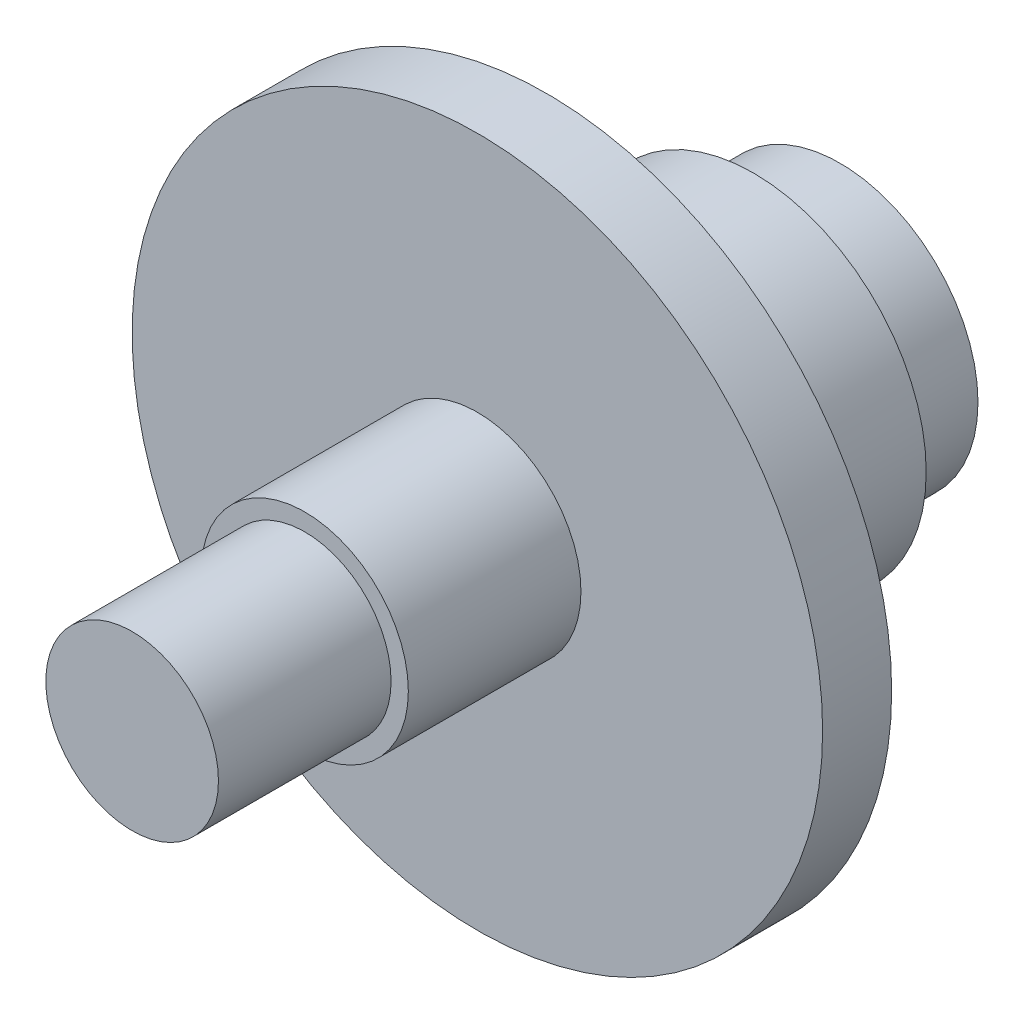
ISO-10303-21;
HEADER;
FILE_DESCRIPTION(('STEP AP214'),'2;1');
FILE_NAME('part.step','',(''),(''),'','','');
FILE_SCHEMA(('AUTOMOTIVE_DESIGN { 1 0 10303 214 1 1 1 1 }'));
ENDSEC;
DATA;
#1=APPLICATION_CONTEXT('core data for automotive mechanical design processes');
#2=APPLICATION_PROTOCOL_DEFINITION('international standard','automotive_design',2000,#1);
#3=PRODUCT_CONTEXT('',#1,'mechanical');
#4=PRODUCT('Part','Part','',(#3));
#5=PRODUCT_RELATED_PRODUCT_CATEGORY('part','',(#4));
#6=PRODUCT_DEFINITION_FORMATION('','',#4);
#7=PRODUCT_DEFINITION_CONTEXT('part definition',#1,'design');
#8=PRODUCT_DEFINITION('design','',#6,#7);
#9=PRODUCT_DEFINITION_SHAPE('','',#8);
#10=(LENGTH_UNIT() NAMED_UNIT(*) SI_UNIT(.MILLI.,.METRE.));
#11=(NAMED_UNIT(*) PLANE_ANGLE_UNIT() SI_UNIT($,.RADIAN.));
#12=(NAMED_UNIT(*) SI_UNIT($,.STERADIAN.) SOLID_ANGLE_UNIT());
#13=UNCERTAINTY_MEASURE_WITH_UNIT(LENGTH_MEASURE(1.E-05),#10,'distance_accuracy_value','');
#14=(GEOMETRIC_REPRESENTATION_CONTEXT(3) GLOBAL_UNCERTAINTY_ASSIGNED_CONTEXT((#13)) GLOBAL_UNIT_ASSIGNED_CONTEXT((#10,
#11,#12)) REPRESENTATION_CONTEXT('',''));
#15=CARTESIAN_POINT('',(0.,0.,0.));
#16=DIRECTION('',(0.,0.,1.));
#17=DIRECTION('',(1.,0.,0.));
#18=AXIS2_PLACEMENT_3D('',#15,#16,#17);
#19=CARTESIAN_POINT('',(0.,0.,15.5));
#20=DIRECTION('',(0.,0.,1.));
#21=DIRECTION('',(1.,0.,0.));
#22=AXIS2_PLACEMENT_3D('',#19,#20,#21);
#23=PLANE('',#22);
#24=CARTESIAN_POINT('',(0.,0.,15.5));
#25=DIRECTION('',(0.,0.,1.));
#26=DIRECTION('',(1.,0.,0.));
#27=AXIS2_PLACEMENT_3D('',#24,#25,#26);
#28=CIRCLE('',#27,3.);
#29=CARTESIAN_POINT('',(3.,0.,15.5));
#30=VERTEX_POINT('',#29);
#31=EDGE_CURVE('E66',#30,#30,#28,.T.);
#32=ORIENTED_EDGE('',*,*,#31,.T.);
#33=EDGE_LOOP('',(#32));
#34=FACE_BOUND('',#33,.T.);
#35=CARTESIAN_POINT('',(0.,0.,15.5));
#36=DIRECTION('',(0.,0.,1.));
#37=DIRECTION('',(1.,0.,0.));
#38=AXIS2_PLACEMENT_3D('',#35,#36,#37);
#39=CIRCLE('',#38,2.5);
#40=CARTESIAN_POINT('',(2.5,0.,15.5));
#41=VERTEX_POINT('',#40);
#42=EDGE_CURVE('E54',#41,#41,#39,.T.);
#43=ORIENTED_EDGE('',*,*,#42,.F.);
#44=EDGE_LOOP('',(#43));
#45=FACE_BOUND('',#44,.T.);
#46=ADVANCED_FACE('F34',(#34,#45),#23,.T.);
#47=CARTESIAN_POINT('',(0.,0.,10.5));
#48=DIRECTION('',(0.,0.,1.));
#49=DIRECTION('',(1.,0.,0.));
#50=AXIS2_PLACEMENT_3D('',#47,#48,#49);
#51=PLANE('',#50);
#52=CARTESIAN_POINT('',(0.,0.,10.5));
#53=DIRECTION('',(0.,0.,1.));
#54=DIRECTION('',(1.,0.,0.));
#55=AXIS2_PLACEMENT_3D('',#52,#53,#54);
#56=CIRCLE('',#55,10.);
#57=CARTESIAN_POINT('',(10.,0.,10.5));
#58=VERTEX_POINT('',#57);
#59=EDGE_CURVE('E72',#58,#58,#56,.T.);
#60=ORIENTED_EDGE('',*,*,#59,.T.);
#61=EDGE_LOOP('',(#60));
#62=FACE_BOUND('',#61,.T.);
#63=CARTESIAN_POINT('',(0.,0.,10.5));
#64=DIRECTION('',(0.,0.,1.));
#65=DIRECTION('',(1.,0.,0.));
#66=AXIS2_PLACEMENT_3D('',#63,#64,#65);
#67=CIRCLE('',#66,3.);
#68=CARTESIAN_POINT('',(3.,0.,10.5));
#69=VERTEX_POINT('',#68);
#70=EDGE_CURVE('E64',#69,#69,#67,.T.);
#71=ORIENTED_EDGE('',*,*,#70,.F.);
#72=EDGE_LOOP('',(#71));
#73=FACE_BOUND('',#72,.T.);
#74=ADVANCED_FACE('F95',(#62,#73),#51,.T.);
#75=CARTESIAN_POINT('',(0.,0.,2.5));
#76=DIRECTION('',(0.,0.,-1.));
#77=DIRECTION('',(-1.,0.,0.));
#78=AXIS2_PLACEMENT_3D('',#75,#76,#77);
#79=CYLINDRICAL_SURFACE('',#78,4.);
#80=CARTESIAN_POINT('',(0.,0.,2.5));
#81=DIRECTION('',(0.,0.,1.));
#82=DIRECTION('',(1.,0.,0.));
#83=AXIS2_PLACEMENT_3D('',#80,#81,#82);
#84=CIRCLE('',#83,4.);
#85=CARTESIAN_POINT('',(4.,0.,2.5));
#86=VERTEX_POINT('',#85);
#87=EDGE_CURVE('E11',#86,#86,#84,.T.);
#88=ORIENTED_EDGE('',*,*,#87,.F.);
#89=EDGE_LOOP('',(#88));
#90=FACE_BOUND('',#89,.T.);
#91=CARTESIAN_POINT('',(0.,0.,0.));
#92=DIRECTION('',(0.,0.,1.));
#93=DIRECTION('',(1.,0.,0.));
#94=AXIS2_PLACEMENT_3D('',#91,#92,#93);
#95=CIRCLE('',#94,4.);
#96=CARTESIAN_POINT('',(4.,0.,0.));
#97=VERTEX_POINT('',#96);
#98=EDGE_CURVE('E38',#97,#97,#95,.T.);
#99=ORIENTED_EDGE('',*,*,#98,.T.);
#100=EDGE_LOOP('',(#99));
#101=FACE_BOUND('',#100,.T.);
#102=ADVANCED_FACE('F36',(#90,#101),#79,.T.);
#103=CARTESIAN_POINT('',(0.,0.,0.));
#104=DIRECTION('',(0.,0.,1.));
#105=DIRECTION('',(1.,0.,0.));
#106=AXIS2_PLACEMENT_3D('',#103,#104,#105);
#107=PLANE('',#106);
#108=CARTESIAN_POINT('',(0.,0.,0.));
#109=DIRECTION('',(0.,0.,-1.));
#110=DIRECTION('',(-1.,0.,0.));
#111=AXIS2_PLACEMENT_3D('',#108,#109,#110);
#112=CIRCLE('',#111,2.5);
#113=CARTESIAN_POINT('',(-2.5,0.,0.));
#114=VERTEX_POINT('',#113);
#115=EDGE_CURVE('E55',#114,#114,#112,.T.);
#116=ORIENTED_EDGE('',*,*,#115,.F.);
#117=EDGE_LOOP('',(#116));
#118=FACE_BOUND('',#117,.T.);
#119=ORIENTED_EDGE('',*,*,#98,.F.);
#120=EDGE_LOOP('',(#119));
#121=FACE_BOUND('',#120,.T.);
#122=ADVANCED_FACE('F89',(#118,#121),#107,.F.);
#123=CARTESIAN_POINT('',(0.,0.,2.5));
#124=DIRECTION('',(0.,0.,1.));
#125=DIRECTION('',(1.,0.,0.));
#126=AXIS2_PLACEMENT_3D('',#123,#124,#125);
#127=PLANE('',#126);
#128=CARTESIAN_POINT('',(0.,0.,2.5));
#129=DIRECTION('',(0.,0.,1.));
#130=DIRECTION('',(1.,0.,0.));
#131=AXIS2_PLACEMENT_3D('',#128,#129,#130);
#132=CIRCLE('',#131,5.);
#133=CARTESIAN_POINT('',(5.,0.,2.5));
#134=VERTEX_POINT('',#133);
#135=EDGE_CURVE('E75',#134,#134,#132,.T.);
#136=ORIENTED_EDGE('',*,*,#135,.F.);
#137=EDGE_LOOP('',(#136));
#138=FACE_BOUND('',#137,.T.);
#139=ORIENTED_EDGE('',*,*,#87,.T.);
#140=EDGE_LOOP('',(#139));
#141=FACE_BOUND('',#140,.T.);
#142=ADVANCED_FACE('F86',(#138,#141),#127,.F.);
#143=CARTESIAN_POINT('',(0.,0.,8.5));
#144=DIRECTION('',(0.,0.,-1.));
#145=DIRECTION('',(-1.,0.,0.));
#146=AXIS2_PLACEMENT_3D('',#143,#144,#145);
#147=CYLINDRICAL_SURFACE('',#146,5.);
#148=CARTESIAN_POINT('',(0.,0.,8.5));
#149=DIRECTION('',(0.,0.,1.));
#150=DIRECTION('',(1.,0.,0.));
#151=AXIS2_PLACEMENT_3D('',#148,#149,#150);
#152=CIRCLE('',#151,5.);
#153=CARTESIAN_POINT('',(5.,0.,8.5));
#154=VERTEX_POINT('',#153);
#155=EDGE_CURVE('E78',#154,#154,#152,.T.);
#156=ORIENTED_EDGE('',*,*,#155,.F.);
#157=EDGE_LOOP('',(#156));
#158=FACE_BOUND('',#157,.T.);
#159=ORIENTED_EDGE('',*,*,#135,.T.);
#160=EDGE_LOOP('',(#159));
#161=FACE_BOUND('',#160,.T.);
#162=ADVANCED_FACE('F84',(#158,#161),#147,.T.);
#163=CARTESIAN_POINT('',(0.,0.,8.5));
#164=DIRECTION('',(0.,0.,1.));
#165=DIRECTION('',(1.,0.,0.));
#166=AXIS2_PLACEMENT_3D('',#163,#164,#165);
#167=PLANE('',#166);
#168=CARTESIAN_POINT('',(0.,0.,8.5));
#169=DIRECTION('',(0.,0.,1.));
#170=DIRECTION('',(1.,0.,0.));
#171=AXIS2_PLACEMENT_3D('',#168,#169,#170);
#172=CIRCLE('',#171,10.);
#173=CARTESIAN_POINT('',(10.,0.,8.5));
#174=VERTEX_POINT('',#173);
#175=EDGE_CURVE('E69',#174,#174,#172,.T.);
#176=ORIENTED_EDGE('',*,*,#175,.F.);
#177=EDGE_LOOP('',(#176));
#178=FACE_BOUND('',#177,.T.);
#179=ORIENTED_EDGE('',*,*,#155,.T.);
#180=EDGE_LOOP('',(#179));
#181=FACE_BOUND('',#180,.T.);
#182=ADVANCED_FACE('F123',(#178,#181),#167,.F.);
#183=CARTESIAN_POINT('',(0.,0.,10.5));
#184=DIRECTION('',(0.,0.,-1.));
#185=DIRECTION('',(-1.,0.,0.));
#186=AXIS2_PLACEMENT_3D('',#183,#184,#185);
#187=CYLINDRICAL_SURFACE('',#186,10.);
#188=ORIENTED_EDGE('',*,*,#59,.F.);
#189=EDGE_LOOP('',(#188));
#190=FACE_BOUND('',#189,.T.);
#191=ORIENTED_EDGE('',*,*,#175,.T.);
#192=EDGE_LOOP('',(#191));
#193=FACE_BOUND('',#192,.T.);
#194=ADVANCED_FACE('F120',(#190,#193),#187,.T.);
#195=CARTESIAN_POINT('',(0.,0.,15.5));
#196=DIRECTION('',(0.,0.,-1.));
#197=DIRECTION('',(-1.,0.,0.));
#198=AXIS2_PLACEMENT_3D('',#195,#196,#197);
#199=CYLINDRICAL_SURFACE('',#198,3.);
#200=ORIENTED_EDGE('',*,*,#31,.F.);
#201=EDGE_LOOP('',(#200));
#202=FACE_BOUND('',#201,.T.);
#203=ORIENTED_EDGE('',*,*,#70,.T.);
#204=EDGE_LOOP('',(#203));
#205=FACE_BOUND('',#204,.T.);
#206=ADVANCED_FACE('F118',(#202,#205),#199,.T.);
#207=CARTESIAN_POINT('',(0.,0.,20.5));
#208=DIRECTION('',(0.,0.,-1.));
#209=DIRECTION('',(-1.,0.,0.));
#210=AXIS2_PLACEMENT_3D('',#207,#208,#209);
#211=CYLINDRICAL_SURFACE('',#210,2.5);
#212=CARTESIAN_POINT('',(0.,0.,20.5));
#213=DIRECTION('',(0.,0.,1.));
#214=DIRECTION('',(1.,0.,0.));
#215=AXIS2_PLACEMENT_3D('',#212,#213,#214);
#216=CIRCLE('',#215,2.5);
#217=CARTESIAN_POINT('',(2.5,0.,20.5));
#218=VERTEX_POINT('',#217);
#219=EDGE_CURVE('E58',#218,#218,#216,.T.);
#220=ORIENTED_EDGE('',*,*,#219,.F.);
#221=EDGE_LOOP('',(#220));
#222=FACE_BOUND('',#221,.T.);
#223=ORIENTED_EDGE('',*,*,#42,.T.);
#224=EDGE_LOOP('',(#223));
#225=FACE_BOUND('',#224,.T.);
#226=ADVANCED_FACE('F116',(#222,#225),#211,.T.);
#227=CARTESIAN_POINT('',(0.,0.,20.5));
#228=DIRECTION('',(0.,0.,1.));
#229=DIRECTION('',(1.,0.,0.));
#230=AXIS2_PLACEMENT_3D('',#227,#228,#229);
#231=PLANE('',#230);
#232=ORIENTED_EDGE('',*,*,#219,.T.);
#233=EDGE_LOOP('',(#232));
#234=FACE_BOUND('',#233,.T.);
#235=ADVANCED_FACE('F48',(#234),#231,.T.);
#236=CARTESIAN_POINT('',(0.,0.,6.));
#237=DIRECTION('',(0.,0.,-1.));
#238=DIRECTION('',(-1.,0.,0.));
#239=AXIS2_PLACEMENT_3D('',#236,#237,#238);
#240=CONICAL_SURFACE('',#239,2.5,1.02974425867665);
#241=CARTESIAN_POINT('',(0.,0.,7.5021515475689));
#242=VERTEX_POINT('',#241);
#243=VERTEX_LOOP('',#242);
#244=FACE_BOUND('',#243,.T.);
#245=CARTESIAN_POINT('',(0.,0.,6.));
#246=DIRECTION('',(0.,0.,-1.));
#247=DIRECTION('',(-1.,0.,0.));
#248=AXIS2_PLACEMENT_3D('',#245,#246,#247);
#249=CIRCLE('',#248,2.5);
#250=CARTESIAN_POINT('',(-2.5,0.,6.));
#251=VERTEX_POINT('',#250);
#252=EDGE_CURVE('E52',#251,#251,#249,.T.);
#253=ORIENTED_EDGE('',*,*,#252,.T.);
#254=EDGE_LOOP('',(#253));
#255=FACE_BOUND('',#254,.T.);
#256=ADVANCED_FACE('F44',(#244,#255),#240,.F.);
#257=CARTESIAN_POINT('',(0.,0.,0.));
#258=DIRECTION('',(0.,0.,-1.));
#259=DIRECTION('',(-1.,0.,0.));
#260=AXIS2_PLACEMENT_3D('',#257,#258,#259);
#261=CYLINDRICAL_SURFACE('',#260,2.5);
#262=ORIENTED_EDGE('',*,*,#252,.F.);
#263=EDGE_LOOP('',(#262));
#264=FACE_BOUND('',#263,.T.);
#265=ORIENTED_EDGE('',*,*,#115,.T.);
#266=EDGE_LOOP('',(#265));
#267=FACE_BOUND('',#266,.T.);
#268=ADVANCED_FACE('F47',(#264,#267),#261,.F.);
#269=CLOSED_SHELL('',(#46,#74,#102,#122,#142,#162,#182,#194,#206,#226,#235,#256,#268));
#270=MANIFOLD_SOLID_BREP('B2',#269);
#271=ADVANCED_BREP_SHAPE_REPRESENTATION('',(#18,#270),#14);
#272=SHAPE_DEFINITION_REPRESENTATION(#9,#271);
ENDSEC;
END-ISO-10303-21;
